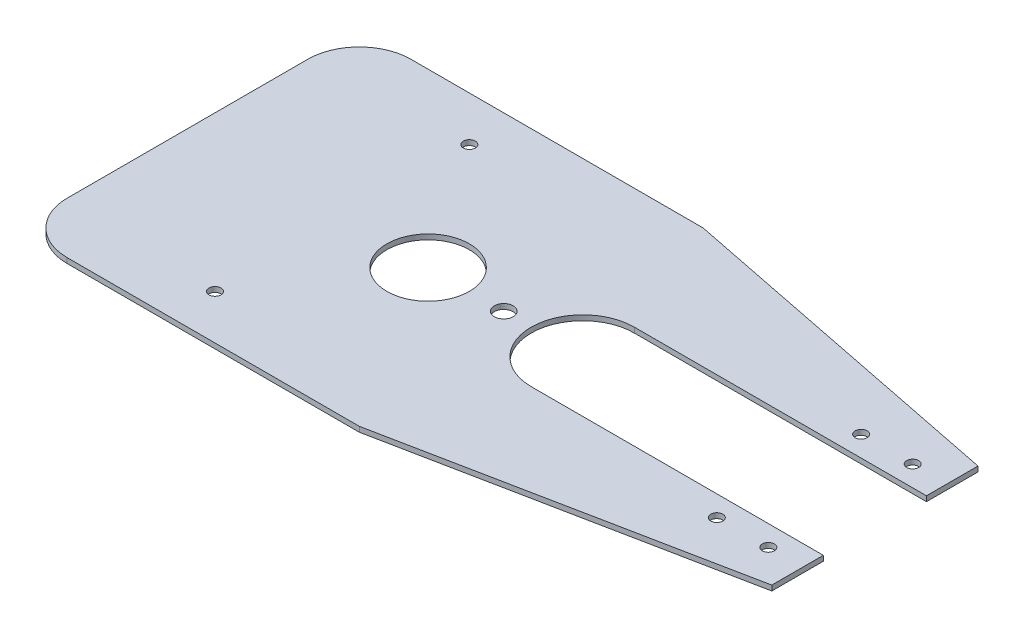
ISO-10303-21;
HEADER;
FILE_DESCRIPTION(('STEP AP214'),'2;1');
FILE_NAME('part.step','',(''),(''),'','','');
FILE_SCHEMA(('AUTOMOTIVE_DESIGN { 1 0 10303 214 1 1 1 1 }'));
ENDSEC;
DATA;
#1=APPLICATION_CONTEXT('core data for automotive mechanical design processes');
#2=APPLICATION_PROTOCOL_DEFINITION('international standard','automotive_design',2000,#1);
#3=PRODUCT_CONTEXT('',#1,'mechanical');
#4=PRODUCT('Part','Part','',(#3));
#5=PRODUCT_RELATED_PRODUCT_CATEGORY('part','',(#4));
#6=PRODUCT_DEFINITION_FORMATION('','',#4);
#7=PRODUCT_DEFINITION_CONTEXT('part definition',#1,'design');
#8=PRODUCT_DEFINITION('design','',#6,#7);
#9=PRODUCT_DEFINITION_SHAPE('','',#8);
#10=(LENGTH_UNIT() NAMED_UNIT(*) SI_UNIT(.MILLI.,.METRE.));
#11=(NAMED_UNIT(*) PLANE_ANGLE_UNIT() SI_UNIT($,.RADIAN.));
#12=(NAMED_UNIT(*) SI_UNIT($,.STERADIAN.) SOLID_ANGLE_UNIT());
#13=UNCERTAINTY_MEASURE_WITH_UNIT(LENGTH_MEASURE(1.E-05),#10,'distance_accuracy_value','');
#14=(GEOMETRIC_REPRESENTATION_CONTEXT(3) GLOBAL_UNCERTAINTY_ASSIGNED_CONTEXT((#13)) GLOBAL_UNIT_ASSIGNED_CONTEXT((#10,
#11,#12)) REPRESENTATION_CONTEXT('',''));
#15=CARTESIAN_POINT('',(0.,0.,0.));
#16=DIRECTION('',(0.,0.,1.));
#17=DIRECTION('',(1.,0.,0.));
#18=AXIS2_PLACEMENT_3D('',#15,#16,#17);
#19=CARTESIAN_POINT('',(115.,1.5,-50.));
#20=DIRECTION('',(0.,1.,0.));
#21=DIRECTION('',(0.,0.,1.));
#22=AXIS2_PLACEMENT_3D('',#19,#20,#21);
#23=PLANE('',#22);
#24=CARTESIAN_POINT('',(45.,1.5,-87.));
#25=DIRECTION('',(0.,1.,0.));
#26=DIRECTION('',(0.,0.,1.));
#27=AXIS2_PLACEMENT_3D('',#24,#25,#26);
#28=CIRCLE('',#27,1.75);
#29=CARTESIAN_POINT('',(45.,1.5,-85.25));
#30=VERTEX_POINT('',#29);
#31=EDGE_CURVE('E306',#30,#30,#28,.T.);
#32=ORIENTED_EDGE('',*,*,#31,.F.);
#33=EDGE_LOOP('',(#32));
#34=FACE_BOUND('',#33,.T.);
#35=CARTESIAN_POINT('',(175.,1.5,-29.));
#36=DIRECTION('',(0.,1.,0.));
#37=DIRECTION('',(0.,0.,1.));
#38=AXIS2_PLACEMENT_3D('',#35,#36,#37);
#39=CIRCLE('',#38,1.75000000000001);
#40=CARTESIAN_POINT('',(175.,1.5,-27.25));
#41=VERTEX_POINT('',#40);
#42=EDGE_CURVE('E318',#41,#41,#39,.T.);
#43=ORIENTED_EDGE('',*,*,#42,.F.);
#44=EDGE_LOOP('',(#43));
#45=FACE_BOUND('',#44,.T.);
#46=CARTESIAN_POINT('',(190.,1.5,-71.));
#47=DIRECTION('',(0.,1.,0.));
#48=DIRECTION('',(0.,0.,1.));
#49=AXIS2_PLACEMENT_3D('',#46,#47,#48);
#50=CIRCLE('',#49,1.75000000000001);
#51=CARTESIAN_POINT('',(190.,1.5,-69.25));
#52=VERTEX_POINT('',#51);
#53=EDGE_CURVE('E330',#52,#52,#50,.T.);
#54=ORIENTED_EDGE('',*,*,#53,.F.);
#55=EDGE_LOOP('',(#54));
#56=FACE_BOUND('',#55,.T.);
#57=CARTESIAN_POINT('',(70.,1.5,-50.));
#58=DIRECTION('',(0.,1.,0.));
#59=DIRECTION('',(0.,0.,1.));
#60=AXIS2_PLACEMENT_3D('',#57,#58,#59);
#61=CIRCLE('',#60,12.);
#62=CARTESIAN_POINT('',(70.,1.5,-38.));
#63=VERTEX_POINT('',#62);
#64=EDGE_CURVE('E156',#63,#63,#61,.T.);
#65=ORIENTED_EDGE('',*,*,#64,.F.);
#66=EDGE_LOOP('',(#65));
#67=FACE_BOUND('',#66,.T.);
#68=DIRECTION('',(-0.98058067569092,0.,-0.196116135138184));
#69=VECTOR('',#68,1.);
#70=CARTESIAN_POINT('',(100.,1.5,-100.));
#71=LINE('',#70,#69);
#72=CARTESIAN_POINT('',(200.,1.5,-80.));
#73=VERTEX_POINT('',#72);
#74=CARTESIAN_POINT('',(100.,1.5,-100.));
#75=VERTEX_POINT('',#74);
#76=EDGE_CURVE('E175',#73,#75,#71,.T.);
#77=ORIENTED_EDGE('',*,*,#76,.T.);
#78=DIRECTION('',(-1.,0.,0.));
#79=VECTOR('',#78,1.);
#80=CARTESIAN_POINT('',(15.0000000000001,1.5,-100.));
#81=LINE('',#80,#79);
#82=CARTESIAN_POINT('',(15.0000000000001,1.5,-100.));
#83=VERTEX_POINT('',#82);
#84=EDGE_CURVE('E103',#75,#83,#81,.T.);
#85=ORIENTED_EDGE('',*,*,#84,.T.);
#86=CARTESIAN_POINT('',(15.,1.5,-85.));
#87=DIRECTION('',(0.,1.,0.));
#88=DIRECTION('',(0.,0.,-1.));
#89=AXIS2_PLACEMENT_3D('',#86,#87,#88);
#90=CIRCLE('',#89,15.);
#91=CARTESIAN_POINT('',(0.,1.5,-84.9999999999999));
#92=VERTEX_POINT('',#91);
#93=EDGE_CURVE('E202',#83,#92,#90,.T.);
#94=ORIENTED_EDGE('',*,*,#93,.T.);
#95=DIRECTION('',(0.,0.,1.));
#96=VECTOR('',#95,1.);
#97=CARTESIAN_POINT('',(0.,1.5,-15.0000000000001));
#98=LINE('',#97,#96);
#99=CARTESIAN_POINT('',(0.,1.5,-15.0000000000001));
#100=VERTEX_POINT('',#99);
#101=EDGE_CURVE('E221',#92,#100,#98,.T.);
#102=ORIENTED_EDGE('',*,*,#101,.T.);
#103=CARTESIAN_POINT('',(15.,1.5,-15.));
#104=DIRECTION('',(0.,1.,0.));
#105=DIRECTION('',(0.,0.,-1.));
#106=AXIS2_PLACEMENT_3D('',#103,#104,#105);
#107=CIRCLE('',#106,15.);
#108=CARTESIAN_POINT('',(15.0000000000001,1.5,0.));
#109=VERTEX_POINT('',#108);
#110=EDGE_CURVE('E218',#100,#109,#107,.T.);
#111=ORIENTED_EDGE('',*,*,#110,.T.);
#112=DIRECTION('',(1.,0.,0.));
#113=VECTOR('',#112,1.);
#114=CARTESIAN_POINT('',(15.0000000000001,1.5,0.));
#115=LINE('',#114,#113);
#116=CARTESIAN_POINT('',(100.,1.5,0.));
#117=VERTEX_POINT('',#116);
#118=EDGE_CURVE('E220',#109,#117,#115,.T.);
#119=ORIENTED_EDGE('',*,*,#118,.T.);
#120=DIRECTION('',(0.98058067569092,0.,-0.196116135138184));
#121=VECTOR('',#120,1.);
#122=CARTESIAN_POINT('',(200.,1.5,-20.));
#123=LINE('',#122,#121);
#124=CARTESIAN_POINT('',(200.,1.5,-20.));
#125=VERTEX_POINT('',#124);
#126=EDGE_CURVE('E223',#117,#125,#123,.T.);
#127=ORIENTED_EDGE('',*,*,#126,.T.);
#128=DIRECTION('',(0.,0.,-1.));
#129=VECTOR('',#128,1.);
#130=CARTESIAN_POINT('',(200.,1.5,-20.));
#131=LINE('',#130,#129);
#132=CARTESIAN_POINT('',(200.,1.5,-35.));
#133=VERTEX_POINT('',#132);
#134=EDGE_CURVE('E229',#125,#133,#131,.T.);
#135=ORIENTED_EDGE('',*,*,#134,.T.);
#136=DIRECTION('',(-1.,0.,0.));
#137=VECTOR('',#136,1.);
#138=CARTESIAN_POINT('',(115.,1.5,-35.));
#139=LINE('',#138,#137);
#140=CARTESIAN_POINT('',(115.,1.5,-35.));
#141=VERTEX_POINT('',#140);
#142=EDGE_CURVE('E134',#133,#141,#139,.T.);
#143=ORIENTED_EDGE('',*,*,#142,.T.);
#144=CARTESIAN_POINT('',(115.,1.5,-50.));
#145=DIRECTION('',(0.,-1.,0.));
#146=DIRECTION('',(0.,0.,1.));
#147=AXIS2_PLACEMENT_3D('',#144,#145,#146);
#148=CIRCLE('',#147,15.);
#149=CARTESIAN_POINT('',(115.,1.5,-65.));
#150=VERTEX_POINT('',#149);
#151=EDGE_CURVE('E128',#141,#150,#148,.T.);
#152=ORIENTED_EDGE('',*,*,#151,.T.);
#153=DIRECTION('',(1.,0.,0.));
#154=VECTOR('',#153,1.);
#155=CARTESIAN_POINT('',(115.,1.5,-65.));
#156=LINE('',#155,#154);
#157=CARTESIAN_POINT('',(200.,1.5,-65.));
#158=VERTEX_POINT('',#157);
#159=EDGE_CURVE('E132',#150,#158,#156,.T.);
#160=ORIENTED_EDGE('',*,*,#159,.T.);
#161=DIRECTION('',(0.,0.,-1.));
#162=VECTOR('',#161,1.);
#163=CARTESIAN_POINT('',(200.,1.5,-65.));
#164=LINE('',#163,#162);
#165=EDGE_CURVE('E48',#158,#73,#164,.T.);
#166=ORIENTED_EDGE('',*,*,#165,.T.);
#167=EDGE_LOOP('',(#77,#85,#94,#102,#111,#119,#127,#135,#143,#152,#160,#166));
#168=FACE_BOUND('',#167,.T.);
#169=CARTESIAN_POINT('',(92.,1.5,-50.));
#170=DIRECTION('',(0.,1.,0.));
#171=DIRECTION('',(0.,0.,1.));
#172=AXIS2_PLACEMENT_3D('',#169,#170,#171);
#173=CIRCLE('',#172,2.75000000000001);
#174=CARTESIAN_POINT('',(92.,1.5,-47.25));
#175=VERTEX_POINT('',#174);
#176=EDGE_CURVE('E336',#175,#175,#173,.T.);
#177=ORIENTED_EDGE('',*,*,#176,.F.);
#178=EDGE_LOOP('',(#177));
#179=FACE_BOUND('',#178,.T.);
#180=CARTESIAN_POINT('',(175.,1.5,-71.));
#181=DIRECTION('',(0.,1.,0.));
#182=DIRECTION('',(0.,0.,1.));
#183=AXIS2_PLACEMENT_3D('',#180,#181,#182);
#184=CIRCLE('',#183,1.75000000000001);
#185=CARTESIAN_POINT('',(175.,1.5,-69.25));
#186=VERTEX_POINT('',#185);
#187=EDGE_CURVE('E324',#186,#186,#184,.T.);
#188=ORIENTED_EDGE('',*,*,#187,.F.);
#189=EDGE_LOOP('',(#188));
#190=FACE_BOUND('',#189,.T.);
#191=CARTESIAN_POINT('',(190.,1.5,-29.));
#192=DIRECTION('',(0.,1.,0.));
#193=DIRECTION('',(0.,0.,1.));
#194=AXIS2_PLACEMENT_3D('',#191,#192,#193);
#195=CIRCLE('',#194,1.75000000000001);
#196=CARTESIAN_POINT('',(190.,1.5,-27.25));
#197=VERTEX_POINT('',#196);
#198=EDGE_CURVE('E312',#197,#197,#195,.T.);
#199=ORIENTED_EDGE('',*,*,#198,.F.);
#200=EDGE_LOOP('',(#199));
#201=FACE_BOUND('',#200,.T.);
#202=CARTESIAN_POINT('',(45.,1.5,-13.));
#203=DIRECTION('',(0.,1.,0.));
#204=DIRECTION('',(0.,0.,1.));
#205=AXIS2_PLACEMENT_3D('',#202,#203,#204);
#206=CIRCLE('',#205,1.75);
#207=CARTESIAN_POINT('',(45.,1.5,-11.25));
#208=VERTEX_POINT('',#207);
#209=EDGE_CURVE('E297',#208,#208,#206,.T.);
#210=ORIENTED_EDGE('',*,*,#209,.F.);
#211=EDGE_LOOP('',(#210));
#212=FACE_BOUND('',#211,.T.);
#213=ADVANCED_FACE('F31',(#34,#45,#56,#67,#168,#179,#190,#201,#212),#23,.T.);
#214=CARTESIAN_POINT('',(115.,0.,-50.));
#215=DIRECTION('',(0.,1.,0.));
#216=DIRECTION('',(0.,0.,1.));
#217=AXIS2_PLACEMENT_3D('',#214,#215,#216);
#218=PLANE('',#217);
#219=CARTESIAN_POINT('',(45.,0.,-87.));
#220=DIRECTION('',(0.,1.,0.));
#221=DIRECTION('',(0.,0.,1.));
#222=AXIS2_PLACEMENT_3D('',#219,#220,#221);
#223=CIRCLE('',#222,1.75);
#224=CARTESIAN_POINT('',(45.,0.,-85.25));
#225=VERTEX_POINT('',#224);
#226=EDGE_CURVE('E303',#225,#225,#223,.T.);
#227=ORIENTED_EDGE('',*,*,#226,.T.);
#228=EDGE_LOOP('',(#227));
#229=FACE_BOUND('',#228,.T.);
#230=CARTESIAN_POINT('',(175.,0.,-29.));
#231=DIRECTION('',(0.,1.,0.));
#232=DIRECTION('',(0.,0.,1.));
#233=AXIS2_PLACEMENT_3D('',#230,#231,#232);
#234=CIRCLE('',#233,1.75000000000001);
#235=CARTESIAN_POINT('',(175.,0.,-27.25));
#236=VERTEX_POINT('',#235);
#237=EDGE_CURVE('E315',#236,#236,#234,.T.);
#238=ORIENTED_EDGE('',*,*,#237,.T.);
#239=EDGE_LOOP('',(#238));
#240=FACE_BOUND('',#239,.T.);
#241=CARTESIAN_POINT('',(190.,0.,-71.));
#242=DIRECTION('',(0.,1.,0.));
#243=DIRECTION('',(0.,0.,1.));
#244=AXIS2_PLACEMENT_3D('',#241,#242,#243);
#245=CIRCLE('',#244,1.75000000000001);
#246=CARTESIAN_POINT('',(190.,0.,-69.25));
#247=VERTEX_POINT('',#246);
#248=EDGE_CURVE('E327',#247,#247,#245,.T.);
#249=ORIENTED_EDGE('',*,*,#248,.T.);
#250=EDGE_LOOP('',(#249));
#251=FACE_BOUND('',#250,.T.);
#252=CARTESIAN_POINT('',(70.,0.,-50.));
#253=DIRECTION('',(0.,1.,0.));
#254=DIRECTION('',(0.,0.,1.));
#255=AXIS2_PLACEMENT_3D('',#252,#253,#254);
#256=CIRCLE('',#255,12.);
#257=CARTESIAN_POINT('',(70.,0.,-38.));
#258=VERTEX_POINT('',#257);
#259=EDGE_CURVE('E339',#258,#258,#256,.T.);
#260=ORIENTED_EDGE('',*,*,#259,.T.);
#261=EDGE_LOOP('',(#260));
#262=FACE_BOUND('',#261,.T.);
#263=DIRECTION('',(-0.98058067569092,0.,-0.196116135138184));
#264=VECTOR('',#263,1.);
#265=CARTESIAN_POINT('',(100.,0.,-100.));
#266=LINE('',#265,#264);
#267=CARTESIAN_POINT('',(200.,0.,-80.));
#268=VERTEX_POINT('',#267);
#269=CARTESIAN_POINT('',(100.,0.,-100.));
#270=VERTEX_POINT('',#269);
#271=EDGE_CURVE('E152',#268,#270,#266,.T.);
#272=ORIENTED_EDGE('',*,*,#271,.F.);
#273=DIRECTION('',(0.,0.,-1.));
#274=VECTOR('',#273,1.);
#275=CARTESIAN_POINT('',(200.,0.,-65.));
#276=LINE('',#275,#274);
#277=CARTESIAN_POINT('',(200.,0.,-65.));
#278=VERTEX_POINT('',#277);
#279=EDGE_CURVE('E95',#278,#268,#276,.T.);
#280=ORIENTED_EDGE('',*,*,#279,.F.);
#281=DIRECTION('',(1.,0.,0.));
#282=VECTOR('',#281,1.);
#283=CARTESIAN_POINT('',(115.,0.,-65.));
#284=LINE('',#283,#282);
#285=CARTESIAN_POINT('',(115.,0.,-65.));
#286=VERTEX_POINT('',#285);
#287=EDGE_CURVE('E89',#286,#278,#284,.T.);
#288=ORIENTED_EDGE('',*,*,#287,.F.);
#289=CARTESIAN_POINT('',(115.,0.,-50.));
#290=DIRECTION('',(0.,-1.,0.));
#291=DIRECTION('',(0.,0.,1.));
#292=AXIS2_PLACEMENT_3D('',#289,#290,#291);
#293=CIRCLE('',#292,15.);
#294=CARTESIAN_POINT('',(115.,0.,-35.));
#295=VERTEX_POINT('',#294);
#296=EDGE_CURVE('E142',#295,#286,#293,.T.);
#297=ORIENTED_EDGE('',*,*,#296,.F.);
#298=DIRECTION('',(-1.,0.,0.));
#299=VECTOR('',#298,1.);
#300=CARTESIAN_POINT('',(115.,0.,-35.));
#301=LINE('',#300,#299);
#302=CARTESIAN_POINT('',(200.,0.,-35.));
#303=VERTEX_POINT('',#302);
#304=EDGE_CURVE('E170',#303,#295,#301,.T.);
#305=ORIENTED_EDGE('',*,*,#304,.F.);
#306=DIRECTION('',(0.,0.,-1.));
#307=VECTOR('',#306,1.);
#308=CARTESIAN_POINT('',(200.,0.,-20.));
#309=LINE('',#308,#307);
#310=CARTESIAN_POINT('',(200.,0.,-20.));
#311=VERTEX_POINT('',#310);
#312=EDGE_CURVE('E168',#311,#303,#309,.T.);
#313=ORIENTED_EDGE('',*,*,#312,.F.);
#314=DIRECTION('',(0.98058067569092,0.,-0.196116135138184));
#315=VECTOR('',#314,1.);
#316=CARTESIAN_POINT('',(200.,0.,-20.));
#317=LINE('',#316,#315);
#318=CARTESIAN_POINT('',(100.,0.,0.));
#319=VERTEX_POINT('',#318);
#320=EDGE_CURVE('E166',#319,#311,#317,.T.);
#321=ORIENTED_EDGE('',*,*,#320,.F.);
#322=DIRECTION('',(1.,0.,0.));
#323=VECTOR('',#322,1.);
#324=CARTESIAN_POINT('',(15.0000000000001,0.,0.));
#325=LINE('',#324,#323);
#326=CARTESIAN_POINT('',(15.0000000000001,0.,0.));
#327=VERTEX_POINT('',#326);
#328=EDGE_CURVE('E164',#327,#319,#325,.T.);
#329=ORIENTED_EDGE('',*,*,#328,.F.);
#330=CARTESIAN_POINT('',(15.,0.,-15.));
#331=DIRECTION('',(0.,1.,0.));
#332=DIRECTION('',(0.,0.,-1.));
#333=AXIS2_PLACEMENT_3D('',#330,#331,#332);
#334=CIRCLE('',#333,15.);
#335=CARTESIAN_POINT('',(0.,0.,-15.0000000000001));
#336=VERTEX_POINT('',#335);
#337=EDGE_CURVE('E162',#336,#327,#334,.T.);
#338=ORIENTED_EDGE('',*,*,#337,.F.);
#339=DIRECTION('',(0.,0.,1.));
#340=VECTOR('',#339,1.);
#341=CARTESIAN_POINT('',(0.,0.,-15.0000000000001));
#342=LINE('',#341,#340);
#343=CARTESIAN_POINT('',(0.,0.,-84.9999999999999));
#344=VERTEX_POINT('',#343);
#345=EDGE_CURVE('E160',#344,#336,#342,.T.);
#346=ORIENTED_EDGE('',*,*,#345,.F.);
#347=CARTESIAN_POINT('',(15.,0.,-85.));
#348=DIRECTION('',(0.,1.,0.));
#349=DIRECTION('',(0.,0.,-1.));
#350=AXIS2_PLACEMENT_3D('',#347,#348,#349);
#351=CIRCLE('',#350,15.);
#352=CARTESIAN_POINT('',(15.0000000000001,0.,-100.));
#353=VERTEX_POINT('',#352);
#354=EDGE_CURVE('E158',#353,#344,#351,.T.);
#355=ORIENTED_EDGE('',*,*,#354,.F.);
#356=DIRECTION('',(-1.,0.,0.));
#357=VECTOR('',#356,1.);
#358=CARTESIAN_POINT('',(15.0000000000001,0.,-100.));
#359=LINE('',#358,#357);
#360=EDGE_CURVE('E155',#270,#353,#359,.T.);
#361=ORIENTED_EDGE('',*,*,#360,.F.);
#362=EDGE_LOOP('',(#272,#280,#288,#297,#305,#313,#321,#329,#338,#346,#355,#361));
#363=FACE_BOUND('',#362,.T.);
#364=CARTESIAN_POINT('',(92.,0.,-50.));
#365=DIRECTION('',(0.,1.,0.));
#366=DIRECTION('',(0.,0.,1.));
#367=AXIS2_PLACEMENT_3D('',#364,#365,#366);
#368=CIRCLE('',#367,2.75000000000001);
#369=CARTESIAN_POINT('',(92.,0.,-47.25));
#370=VERTEX_POINT('',#369);
#371=EDGE_CURVE('E333',#370,#370,#368,.T.);
#372=ORIENTED_EDGE('',*,*,#371,.T.);
#373=EDGE_LOOP('',(#372));
#374=FACE_BOUND('',#373,.T.);
#375=CARTESIAN_POINT('',(175.,0.,-71.));
#376=DIRECTION('',(0.,1.,0.));
#377=DIRECTION('',(0.,0.,1.));
#378=AXIS2_PLACEMENT_3D('',#375,#376,#377);
#379=CIRCLE('',#378,1.75000000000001);
#380=CARTESIAN_POINT('',(175.,0.,-69.25));
#381=VERTEX_POINT('',#380);
#382=EDGE_CURVE('E321',#381,#381,#379,.T.);
#383=ORIENTED_EDGE('',*,*,#382,.T.);
#384=EDGE_LOOP('',(#383));
#385=FACE_BOUND('',#384,.T.);
#386=CARTESIAN_POINT('',(190.,0.,-29.));
#387=DIRECTION('',(0.,1.,0.));
#388=DIRECTION('',(0.,0.,1.));
#389=AXIS2_PLACEMENT_3D('',#386,#387,#388);
#390=CIRCLE('',#389,1.75000000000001);
#391=CARTESIAN_POINT('',(190.,0.,-27.25));
#392=VERTEX_POINT('',#391);
#393=EDGE_CURVE('E309',#392,#392,#390,.T.);
#394=ORIENTED_EDGE('',*,*,#393,.T.);
#395=EDGE_LOOP('',(#394));
#396=FACE_BOUND('',#395,.T.);
#397=CARTESIAN_POINT('',(45.,0.,-13.));
#398=DIRECTION('',(0.,1.,0.));
#399=DIRECTION('',(0.,0.,1.));
#400=AXIS2_PLACEMENT_3D('',#397,#398,#399);
#401=CIRCLE('',#400,1.75);
#402=CARTESIAN_POINT('',(45.,0.,-11.25));
#403=VERTEX_POINT('',#402);
#404=EDGE_CURVE('E300',#403,#403,#401,.T.);
#405=ORIENTED_EDGE('',*,*,#404,.T.);
#406=EDGE_LOOP('',(#405));
#407=FACE_BOUND('',#406,.T.);
#408=ADVANCED_FACE('F206',(#229,#240,#251,#262,#363,#374,#385,#396,#407),#218,.F.);
#409=CARTESIAN_POINT('',(100.,1.5,-100.));
#410=DIRECTION('',(-0.196116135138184,0.,0.98058067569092));
#411=DIRECTION('',(0.98058067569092,0.,0.196116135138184));
#412=AXIS2_PLACEMENT_3D('',#409,#410,#411);
#413=PLANE('',#412);
#414=ORIENTED_EDGE('',*,*,#271,.T.);
#415=DIRECTION('',(0.,-1.,0.));
#416=VECTOR('',#415,1.);
#417=CARTESIAN_POINT('',(100.,1.5,-100.));
#418=LINE('',#417,#416);
#419=EDGE_CURVE('E11',#75,#270,#418,.T.);
#420=ORIENTED_EDGE('',*,*,#419,.F.);
#421=ORIENTED_EDGE('',*,*,#76,.F.);
#422=DIRECTION('',(0.,-1.,0.));
#423=VECTOR('',#422,1.);
#424=CARTESIAN_POINT('',(200.,1.5,-80.));
#425=LINE('',#424,#423);
#426=EDGE_CURVE('E148',#73,#268,#425,.T.);
#427=ORIENTED_EDGE('',*,*,#426,.T.);
#428=EDGE_LOOP('',(#414,#420,#421,#427));
#429=FACE_BOUND('',#428,.T.);
#430=ADVANCED_FACE('F33',(#429),#413,.F.);
#431=CARTESIAN_POINT('',(15.0000000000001,1.5,-100.));
#432=DIRECTION('',(0.,0.,1.));
#433=DIRECTION('',(1.,0.,0.));
#434=AXIS2_PLACEMENT_3D('',#431,#432,#433);
#435=PLANE('',#434);
#436=ORIENTED_EDGE('',*,*,#360,.T.);
#437=DIRECTION('',(0.,-1.,0.));
#438=VECTOR('',#437,1.);
#439=CARTESIAN_POINT('',(15.0000000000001,1.5,-100.));
#440=LINE('',#439,#438);
#441=EDGE_CURVE('E40',#83,#353,#440,.T.);
#442=ORIENTED_EDGE('',*,*,#441,.F.);
#443=ORIENTED_EDGE('',*,*,#84,.F.);
#444=ORIENTED_EDGE('',*,*,#419,.T.);
#445=EDGE_LOOP('',(#436,#442,#443,#444));
#446=FACE_BOUND('',#445,.T.);
#447=ADVANCED_FACE('F484',(#446),#435,.F.);
#448=CARTESIAN_POINT('',(15.,1.5,-85.));
#449=DIRECTION('',(0.,-1.,0.));
#450=DIRECTION('',(0.,0.,-1.));
#451=AXIS2_PLACEMENT_3D('',#448,#449,#450);
#452=CYLINDRICAL_SURFACE('',#451,15.);
#453=ORIENTED_EDGE('',*,*,#354,.T.);
#454=DIRECTION('',(0.,-1.,0.));
#455=VECTOR('',#454,1.);
#456=CARTESIAN_POINT('',(0.,1.5,-84.9999999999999));
#457=LINE('',#456,#455);
#458=EDGE_CURVE('E194',#92,#344,#457,.T.);
#459=ORIENTED_EDGE('',*,*,#458,.F.);
#460=ORIENTED_EDGE('',*,*,#93,.F.);
#461=ORIENTED_EDGE('',*,*,#441,.T.);
#462=EDGE_LOOP('',(#453,#459,#460,#461));
#463=FACE_BOUND('',#462,.T.);
#464=ADVANCED_FACE('F200',(#463),#452,.T.);
#465=CARTESIAN_POINT('',(0.,1.5,-15.0000000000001));
#466=DIRECTION('',(1.,0.,0.));
#467=DIRECTION('',(0.,0.,-1.));
#468=AXIS2_PLACEMENT_3D('',#465,#466,#467);
#469=PLANE('',#468);
#470=ORIENTED_EDGE('',*,*,#345,.T.);
#471=DIRECTION('',(0.,-1.,0.));
#472=VECTOR('',#471,1.);
#473=CARTESIAN_POINT('',(0.,1.5,-15.0000000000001));
#474=LINE('',#473,#472);
#475=EDGE_CURVE('E191',#100,#336,#474,.T.);
#476=ORIENTED_EDGE('',*,*,#475,.F.);
#477=ORIENTED_EDGE('',*,*,#101,.F.);
#478=ORIENTED_EDGE('',*,*,#458,.T.);
#479=EDGE_LOOP('',(#470,#476,#477,#478));
#480=FACE_BOUND('',#479,.T.);
#481=ADVANCED_FACE('F212',(#480),#469,.F.);
#482=CARTESIAN_POINT('',(15.,1.5,-15.));
#483=DIRECTION('',(0.,-1.,0.));
#484=DIRECTION('',(0.,0.,-1.));
#485=AXIS2_PLACEMENT_3D('',#482,#483,#484);
#486=CYLINDRICAL_SURFACE('',#485,15.);
#487=ORIENTED_EDGE('',*,*,#337,.T.);
#488=DIRECTION('',(0.,-1.,0.));
#489=VECTOR('',#488,1.);
#490=CARTESIAN_POINT('',(15.0000000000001,1.5,0.));
#491=LINE('',#490,#489);
#492=EDGE_CURVE('E188',#109,#327,#491,.T.);
#493=ORIENTED_EDGE('',*,*,#492,.F.);
#494=ORIENTED_EDGE('',*,*,#110,.F.);
#495=ORIENTED_EDGE('',*,*,#475,.T.);
#496=EDGE_LOOP('',(#487,#493,#494,#495));
#497=FACE_BOUND('',#496,.T.);
#498=ADVANCED_FACE('F216',(#497),#486,.T.);
#499=CARTESIAN_POINT('',(15.0000000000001,1.5,0.));
#500=DIRECTION('',(0.,0.,-1.));
#501=DIRECTION('',(-1.,0.,0.));
#502=AXIS2_PLACEMENT_3D('',#499,#500,#501);
#503=PLANE('',#502);
#504=ORIENTED_EDGE('',*,*,#328,.T.);
#505=DIRECTION('',(0.,-1.,0.));
#506=VECTOR('',#505,1.);
#507=CARTESIAN_POINT('',(100.,1.5,0.));
#508=LINE('',#507,#506);
#509=EDGE_CURVE('E185',#117,#319,#508,.T.);
#510=ORIENTED_EDGE('',*,*,#509,.F.);
#511=ORIENTED_EDGE('',*,*,#118,.F.);
#512=ORIENTED_EDGE('',*,*,#492,.T.);
#513=EDGE_LOOP('',(#504,#510,#511,#512));
#514=FACE_BOUND('',#513,.T.);
#515=ADVANCED_FACE('F449',(#514),#503,.F.);
#516=CARTESIAN_POINT('',(200.,1.5,-20.));
#517=DIRECTION('',(-0.196116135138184,0.,-0.98058067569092));
#518=DIRECTION('',(-0.98058067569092,0.,0.196116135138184));
#519=AXIS2_PLACEMENT_3D('',#516,#517,#518);
#520=PLANE('',#519);
#521=ORIENTED_EDGE('',*,*,#320,.T.);
#522=DIRECTION('',(0.,-1.,0.));
#523=VECTOR('',#522,1.);
#524=CARTESIAN_POINT('',(200.,1.5,-20.));
#525=LINE('',#524,#523);
#526=EDGE_CURVE('E182',#125,#311,#525,.T.);
#527=ORIENTED_EDGE('',*,*,#526,.F.);
#528=ORIENTED_EDGE('',*,*,#126,.F.);
#529=ORIENTED_EDGE('',*,*,#509,.T.);
#530=EDGE_LOOP('',(#521,#527,#528,#529));
#531=FACE_BOUND('',#530,.T.);
#532=ADVANCED_FACE('F440',(#531),#520,.F.);
#533=CARTESIAN_POINT('',(200.,1.5,-20.));
#534=DIRECTION('',(-1.,0.,0.));
#535=DIRECTION('',(0.,0.,1.));
#536=AXIS2_PLACEMENT_3D('',#533,#534,#535);
#537=PLANE('',#536);
#538=ORIENTED_EDGE('',*,*,#312,.T.);
#539=DIRECTION('',(0.,-1.,0.));
#540=VECTOR('',#539,1.);
#541=CARTESIAN_POINT('',(200.,1.5,-35.));
#542=LINE('',#541,#540);
#543=EDGE_CURVE('E179',#133,#303,#542,.T.);
#544=ORIENTED_EDGE('',*,*,#543,.F.);
#545=ORIENTED_EDGE('',*,*,#134,.F.);
#546=ORIENTED_EDGE('',*,*,#526,.T.);
#547=EDGE_LOOP('',(#538,#544,#545,#546));
#548=FACE_BOUND('',#547,.T.);
#549=ADVANCED_FACE('F235',(#548),#537,.F.);
#550=CARTESIAN_POINT('',(115.,1.5,-35.));
#551=DIRECTION('',(0.,0.,1.));
#552=DIRECTION('',(1.,0.,0.));
#553=AXIS2_PLACEMENT_3D('',#550,#551,#552);
#554=PLANE('',#553);
#555=ORIENTED_EDGE('',*,*,#304,.T.);
#556=DIRECTION('',(0.,-1.,0.));
#557=VECTOR('',#556,1.);
#558=CARTESIAN_POINT('',(115.,1.5,-35.));
#559=LINE('',#558,#557);
#560=EDGE_CURVE('E143',#141,#295,#559,.T.);
#561=ORIENTED_EDGE('',*,*,#560,.F.);
#562=ORIENTED_EDGE('',*,*,#142,.F.);
#563=ORIENTED_EDGE('',*,*,#543,.T.);
#564=EDGE_LOOP('',(#555,#561,#562,#563));
#565=FACE_BOUND('',#564,.T.);
#566=ADVANCED_FACE('F239',(#565),#554,.F.);
#567=CARTESIAN_POINT('',(115.,1.5,-50.));
#568=DIRECTION('',(0.,-1.,0.));
#569=DIRECTION('',(0.,0.,-1.));
#570=AXIS2_PLACEMENT_3D('',#567,#568,#569);
#571=CYLINDRICAL_SURFACE('',#570,15.);
#572=ORIENTED_EDGE('',*,*,#296,.T.);
#573=DIRECTION('',(0.,-1.,0.));
#574=VECTOR('',#573,1.);
#575=CARTESIAN_POINT('',(115.,1.5,-65.));
#576=LINE('',#575,#574);
#577=EDGE_CURVE('E139',#150,#286,#576,.T.);
#578=ORIENTED_EDGE('',*,*,#577,.F.);
#579=ORIENTED_EDGE('',*,*,#151,.F.);
#580=ORIENTED_EDGE('',*,*,#560,.T.);
#581=EDGE_LOOP('',(#572,#578,#579,#580));
#582=FACE_BOUND('',#581,.T.);
#583=ADVANCED_FACE('F140',(#582),#571,.F.);
#584=CARTESIAN_POINT('',(115.,1.5,-65.));
#585=DIRECTION('',(0.,0.,-1.));
#586=DIRECTION('',(-1.,0.,0.));
#587=AXIS2_PLACEMENT_3D('',#584,#585,#586);
#588=PLANE('',#587);
#589=ORIENTED_EDGE('',*,*,#287,.T.);
#590=DIRECTION('',(0.,-1.,0.));
#591=VECTOR('',#590,1.);
#592=CARTESIAN_POINT('',(200.,1.5,-65.));
#593=LINE('',#592,#591);
#594=EDGE_CURVE('E144',#158,#278,#593,.T.);
#595=ORIENTED_EDGE('',*,*,#594,.F.);
#596=ORIENTED_EDGE('',*,*,#159,.F.);
#597=ORIENTED_EDGE('',*,*,#577,.T.);
#598=EDGE_LOOP('',(#589,#595,#596,#597));
#599=FACE_BOUND('',#598,.T.);
#600=ADVANCED_FACE('F146',(#599),#588,.F.);
#601=CARTESIAN_POINT('',(200.,1.5,-65.));
#602=DIRECTION('',(-1.,0.,0.));
#603=DIRECTION('',(0.,0.,1.));
#604=AXIS2_PLACEMENT_3D('',#601,#602,#603);
#605=PLANE('',#604);
#606=ORIENTED_EDGE('',*,*,#279,.T.);
#607=ORIENTED_EDGE('',*,*,#426,.F.);
#608=ORIENTED_EDGE('',*,*,#165,.F.);
#609=ORIENTED_EDGE('',*,*,#594,.T.);
#610=EDGE_LOOP('',(#606,#607,#608,#609));
#611=FACE_BOUND('',#610,.T.);
#612=ADVANCED_FACE('F243',(#611),#605,.F.);
#613=CARTESIAN_POINT('',(70.,1.5,-50.));
#614=DIRECTION('',(0.,-1.,0.));
#615=DIRECTION('',(0.,0.,-1.));
#616=AXIS2_PLACEMENT_3D('',#613,#614,#615);
#617=CYLINDRICAL_SURFACE('',#616,12.);
#618=ORIENTED_EDGE('',*,*,#64,.T.);
#619=EDGE_LOOP('',(#618));
#620=FACE_BOUND('',#619,.T.);
#621=ORIENTED_EDGE('',*,*,#259,.F.);
#622=EDGE_LOOP('',(#621));
#623=FACE_BOUND('',#622,.T.);
#624=ADVANCED_FACE('F245',(#620,#623),#617,.F.);
#625=CARTESIAN_POINT('',(92.,1.5,-50.));
#626=DIRECTION('',(0.,-1.,0.));
#627=DIRECTION('',(0.,0.,-1.));
#628=AXIS2_PLACEMENT_3D('',#625,#626,#627);
#629=CYLINDRICAL_SURFACE('',#628,2.75000000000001);
#630=ORIENTED_EDGE('',*,*,#176,.T.);
#631=EDGE_LOOP('',(#630));
#632=FACE_BOUND('',#631,.T.);
#633=ORIENTED_EDGE('',*,*,#371,.F.);
#634=EDGE_LOOP('',(#633));
#635=FACE_BOUND('',#634,.T.);
#636=ADVANCED_FACE('F251',(#632,#635),#629,.F.);
#637=CARTESIAN_POINT('',(190.,1.5,-71.));
#638=DIRECTION('',(0.,-1.,0.));
#639=DIRECTION('',(0.,0.,-1.));
#640=AXIS2_PLACEMENT_3D('',#637,#638,#639);
#641=CYLINDRICAL_SURFACE('',#640,1.75000000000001);
#642=ORIENTED_EDGE('',*,*,#53,.T.);
#643=EDGE_LOOP('',(#642));
#644=FACE_BOUND('',#643,.T.);
#645=ORIENTED_EDGE('',*,*,#248,.F.);
#646=EDGE_LOOP('',(#645));
#647=FACE_BOUND('',#646,.T.);
#648=ADVANCED_FACE('F268',(#644,#647),#641,.F.);
#649=CARTESIAN_POINT('',(175.,1.5,-71.));
#650=DIRECTION('',(0.,-1.,0.));
#651=DIRECTION('',(0.,0.,-1.));
#652=AXIS2_PLACEMENT_3D('',#649,#650,#651);
#653=CYLINDRICAL_SURFACE('',#652,1.75000000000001);
#654=ORIENTED_EDGE('',*,*,#187,.T.);
#655=EDGE_LOOP('',(#654));
#656=FACE_BOUND('',#655,.T.);
#657=ORIENTED_EDGE('',*,*,#382,.F.);
#658=EDGE_LOOP('',(#657));
#659=FACE_BOUND('',#658,.T.);
#660=ADVANCED_FACE('F272',(#656,#659),#653,.F.);
#661=CARTESIAN_POINT('',(175.,1.5,-29.));
#662=DIRECTION('',(0.,-1.,0.));
#663=DIRECTION('',(0.,0.,-1.));
#664=AXIS2_PLACEMENT_3D('',#661,#662,#663);
#665=CYLINDRICAL_SURFACE('',#664,1.75000000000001);
#666=ORIENTED_EDGE('',*,*,#42,.T.);
#667=EDGE_LOOP('',(#666));
#668=FACE_BOUND('',#667,.T.);
#669=ORIENTED_EDGE('',*,*,#237,.F.);
#670=EDGE_LOOP('',(#669));
#671=FACE_BOUND('',#670,.T.);
#672=ADVANCED_FACE('F276',(#668,#671),#665,.F.);
#673=CARTESIAN_POINT('',(190.,1.5,-29.));
#674=DIRECTION('',(0.,-1.,0.));
#675=DIRECTION('',(0.,0.,-1.));
#676=AXIS2_PLACEMENT_3D('',#673,#674,#675);
#677=CYLINDRICAL_SURFACE('',#676,1.75000000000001);
#678=ORIENTED_EDGE('',*,*,#198,.T.);
#679=EDGE_LOOP('',(#678));
#680=FACE_BOUND('',#679,.T.);
#681=ORIENTED_EDGE('',*,*,#393,.F.);
#682=EDGE_LOOP('',(#681));
#683=FACE_BOUND('',#682,.T.);
#684=ADVANCED_FACE('F280',(#680,#683),#677,.F.);
#685=CARTESIAN_POINT('',(45.,1.5,-87.));
#686=DIRECTION('',(0.,-1.,0.));
#687=DIRECTION('',(0.,0.,-1.));
#688=AXIS2_PLACEMENT_3D('',#685,#686,#687);
#689=CYLINDRICAL_SURFACE('',#688,1.75);
#690=ORIENTED_EDGE('',*,*,#31,.T.);
#691=EDGE_LOOP('',(#690));
#692=FACE_BOUND('',#691,.T.);
#693=ORIENTED_EDGE('',*,*,#226,.F.);
#694=EDGE_LOOP('',(#693));
#695=FACE_BOUND('',#694,.T.);
#696=ADVANCED_FACE('F284',(#692,#695),#689,.F.);
#697=CARTESIAN_POINT('',(45.,1.5,-13.));
#698=DIRECTION('',(0.,-1.,0.));
#699=DIRECTION('',(0.,0.,-1.));
#700=AXIS2_PLACEMENT_3D('',#697,#698,#699);
#701=CYLINDRICAL_SURFACE('',#700,1.75);
#702=ORIENTED_EDGE('',*,*,#209,.T.);
#703=EDGE_LOOP('',(#702));
#704=FACE_BOUND('',#703,.T.);
#705=ORIENTED_EDGE('',*,*,#404,.F.);
#706=EDGE_LOOP('',(#705));
#707=FACE_BOUND('',#706,.T.);
#708=ADVANCED_FACE('F288',(#704,#707),#701,.F.);
#709=CLOSED_SHELL('',(#213,#408,#430,#447,#464,#481,#498,#515,#532,#549,#566,#583,#600,#612,
#624,#636,#648,#660,#672,#684,#696,#708));
#710=MANIFOLD_SOLID_BREP('B2',#709);
#711=ADVANCED_BREP_SHAPE_REPRESENTATION('',(#18,#710),#14);
#712=SHAPE_DEFINITION_REPRESENTATION(#9,#711);
ENDSEC;
END-ISO-10303-21;
